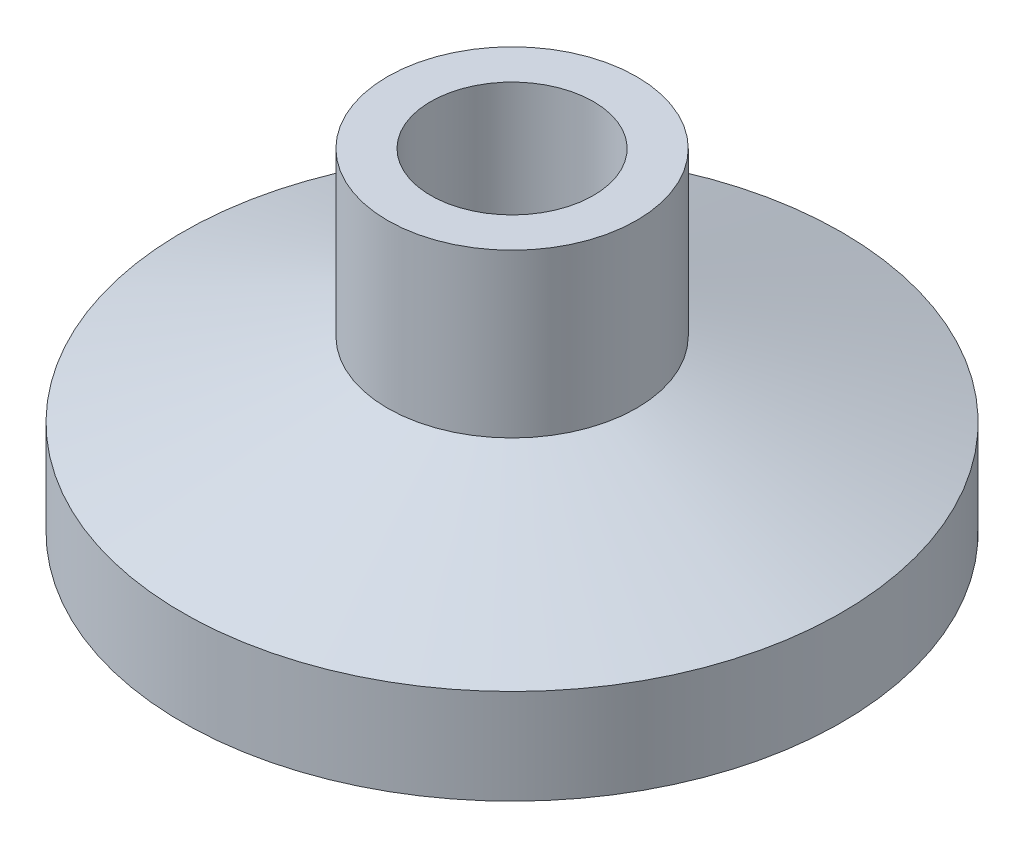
ISO-10303-21;
HEADER;
FILE_DESCRIPTION(('STEP AP214'),'2;1');
FILE_NAME('part.step','',(''),(''),'','','');
FILE_SCHEMA(('AUTOMOTIVE_DESIGN { 1 0 10303 214 1 1 1 1 }'));
ENDSEC;
DATA;
#1=APPLICATION_CONTEXT('core data for automotive mechanical design processes');
#2=APPLICATION_PROTOCOL_DEFINITION('international standard','automotive_design',2000,#1);
#3=PRODUCT_CONTEXT('',#1,'mechanical');
#4=PRODUCT('Part','Part','',(#3));
#5=PRODUCT_RELATED_PRODUCT_CATEGORY('part','',(#4));
#6=PRODUCT_DEFINITION_FORMATION('','',#4);
#7=PRODUCT_DEFINITION_CONTEXT('part definition',#1,'design');
#8=PRODUCT_DEFINITION('design','',#6,#7);
#9=PRODUCT_DEFINITION_SHAPE('','',#8);
#10=(LENGTH_UNIT() NAMED_UNIT(*) SI_UNIT(.MILLI.,.METRE.));
#11=(NAMED_UNIT(*) PLANE_ANGLE_UNIT() SI_UNIT($,.RADIAN.));
#12=(NAMED_UNIT(*) SI_UNIT($,.STERADIAN.) SOLID_ANGLE_UNIT());
#13=UNCERTAINTY_MEASURE_WITH_UNIT(LENGTH_MEASURE(1.E-05),#10,'distance_accuracy_value','');
#14=(GEOMETRIC_REPRESENTATION_CONTEXT(3) GLOBAL_UNCERTAINTY_ASSIGNED_CONTEXT((#13)) GLOBAL_UNIT_ASSIGNED_CONTEXT((#10,
#11,#12)) REPRESENTATION_CONTEXT('',''));
#15=CARTESIAN_POINT('',(0.,0.,0.));
#16=DIRECTION('',(0.,0.,1.));
#17=DIRECTION('',(1.,0.,0.));
#18=AXIS2_PLACEMENT_3D('',#15,#16,#17);
#19=CARTESIAN_POINT('',(0.,0.,0.));
#20=DIRECTION('',(0.,-1.,0.));
#21=DIRECTION('',(0.,0.,-1.));
#22=AXIS2_PLACEMENT_3D('',#19,#20,#21);
#23=CYLINDRICAL_SURFACE('',#22,10.922);
#24=CARTESIAN_POINT('',(0.,1.32079999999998,0.));
#25=DIRECTION('',(0.,-1.,0.));
#26=DIRECTION('',(0.,0.,-1.));
#27=AXIS2_PLACEMENT_3D('',#24,#25,#26);
#28=CIRCLE('',#27,10.922);
#29=CARTESIAN_POINT('',(0.,1.32079999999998,-10.922));
#30=VERTEX_POINT('',#29);
#31=EDGE_CURVE('E12',#30,#30,#28,.T.);
#32=ORIENTED_EDGE('',*,*,#31,.F.);
#33=EDGE_LOOP('',(#32));
#34=FACE_BOUND('',#33,.T.);
#35=CARTESIAN_POINT('',(0.,0.,0.));
#36=DIRECTION('',(0.,-1.,0.));
#37=DIRECTION('',(0.,0.,-1.));
#38=AXIS2_PLACEMENT_3D('',#35,#36,#37);
#39=CIRCLE('',#38,10.922);
#40=CARTESIAN_POINT('',(0.,0.,-10.922));
#41=VERTEX_POINT('',#40);
#42=EDGE_CURVE('E72',#41,#41,#39,.T.);
#43=ORIENTED_EDGE('',*,*,#42,.T.);
#44=EDGE_LOOP('',(#43));
#45=FACE_BOUND('',#44,.T.);
#46=ADVANCED_FACE('F38',(#34,#45),#23,.F.);
#47=CARTESIAN_POINT('',(0.,1.3208,0.));
#48=DIRECTION('',(0.,-1.,0.));
#49=DIRECTION('',(0.,0.,-1.));
#50=AXIS2_PLACEMENT_3D('',#47,#48,#49);
#51=TOROIDAL_SURFACE('',#50,10.1473,0.7747);
#52=CARTESIAN_POINT('',(0.,1.85299891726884,0.));
#53=DIRECTION('',(0.,-1.,0.));
#54=DIRECTION('',(0.,0.,-1.));
#55=AXIS2_PLACEMENT_3D('',#52,#53,#54);
#56=CIRCLE('',#55,9.58433960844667);
#57=CARTESIAN_POINT('',(0.,1.85299891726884,-9.58433960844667));
#58=VERTEX_POINT('',#57);
#59=EDGE_CURVE('E44',#58,#58,#56,.T.);
#60=ORIENTED_EDGE('',*,*,#59,.F.);
#61=EDGE_LOOP('',(#60));
#62=FACE_BOUND('',#61,.T.);
#63=ORIENTED_EDGE('',*,*,#31,.T.);
#64=EDGE_LOOP('',(#63));
#65=FACE_BOUND('',#64,.T.);
#66=ADVANCED_FACE('F121',(#62,#65),#51,.F.);
#67=CARTESIAN_POINT('',(0.,1.85299891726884,0.));
#68=DIRECTION('',(0.,1.,0.));
#69=DIRECTION('',(0.,0.,1.));
#70=AXIS2_PLACEMENT_3D('',#67,#68,#69);
#71=CONICAL_SURFACE('',#70,9.58433960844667,0.794623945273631);
#72=CARTESIAN_POINT('',(0.,0.889000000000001,0.));
#73=DIRECTION('',(0.,-1.,0.));
#74=DIRECTION('',(0.,0.,-1.));
#75=AXIS2_PLACEMENT_3D('',#72,#73,#74);
#76=CIRCLE('',#75,8.60238725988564);
#77=CARTESIAN_POINT('',(0.,0.889000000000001,-8.60238725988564));
#78=VERTEX_POINT('',#77);
#79=EDGE_CURVE('E48',#78,#78,#76,.T.);
#80=ORIENTED_EDGE('',*,*,#79,.F.);
#81=EDGE_LOOP('',(#80));
#82=FACE_BOUND('',#81,.T.);
#83=ORIENTED_EDGE('',*,*,#59,.T.);
#84=EDGE_LOOP('',(#83));
#85=FACE_BOUND('',#84,.T.);
#86=ADVANCED_FACE('F116',(#82,#85),#71,.T.);
#87=CARTESIAN_POINT('',(-8.60238725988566,0.889000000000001,0.));
#88=DIRECTION('',(0.,1.,0.));
#89=DIRECTION('',(0.,0.,1.));
#90=AXIS2_PLACEMENT_3D('',#87,#88,#89);
#91=PLANE('',#90);
#92=CARTESIAN_POINT('',(0.,0.889000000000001,0.));
#93=DIRECTION('',(0.,-1.,0.));
#94=DIRECTION('',(0.,0.,-1.));
#95=AXIS2_PLACEMENT_3D('',#92,#93,#94);
#96=CIRCLE('',#95,3.1115);
#97=CARTESIAN_POINT('',(0.,0.889000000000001,-3.1115));
#98=VERTEX_POINT('',#97);
#99=EDGE_CURVE('E52',#98,#98,#96,.T.);
#100=ORIENTED_EDGE('',*,*,#99,.F.);
#101=EDGE_LOOP('',(#100));
#102=FACE_BOUND('',#101,.T.);
#103=ORIENTED_EDGE('',*,*,#79,.T.);
#104=EDGE_LOOP('',(#103));
#105=FACE_BOUND('',#104,.T.);
#106=ADVANCED_FACE('F110',(#102,#105),#91,.F.);
#107=CARTESIAN_POINT('',(0.,0.,0.));
#108=DIRECTION('',(0.,-1.,0.));
#109=DIRECTION('',(0.,0.,-1.));
#110=AXIS2_PLACEMENT_3D('',#107,#108,#109);
#111=CYLINDRICAL_SURFACE('',#110,3.1115);
#112=CARTESIAN_POINT('',(0.,12.7,0.));
#113=DIRECTION('',(0.,-1.,0.));
#114=DIRECTION('',(0.,0.,-1.));
#115=AXIS2_PLACEMENT_3D('',#112,#113,#114);
#116=CIRCLE('',#115,3.1115);
#117=CARTESIAN_POINT('',(0.,12.7,-3.1115));
#118=VERTEX_POINT('',#117);
#119=EDGE_CURVE('E57',#118,#118,#116,.T.);
#120=ORIENTED_EDGE('',*,*,#119,.F.);
#121=EDGE_LOOP('',(#120));
#122=FACE_BOUND('',#121,.T.);
#123=ORIENTED_EDGE('',*,*,#99,.T.);
#124=EDGE_LOOP('',(#123));
#125=FACE_BOUND('',#124,.T.);
#126=ADVANCED_FACE('F104',(#122,#125),#111,.F.);
#127=CARTESIAN_POINT('',(-3.11149999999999,12.7,0.));
#128=DIRECTION('',(0.,-1.,0.));
#129=DIRECTION('',(0.,0.,-1.));
#130=AXIS2_PLACEMENT_3D('',#127,#128,#129);
#131=PLANE('',#130);
#132=CARTESIAN_POINT('',(0.,12.7,0.));
#133=DIRECTION('',(0.,-1.,0.));
#134=DIRECTION('',(0.,0.,-1.));
#135=AXIS2_PLACEMENT_3D('',#132,#133,#134);
#136=CIRCLE('',#135,4.7625);
#137=CARTESIAN_POINT('',(0.,12.7,-4.7625));
#138=VERTEX_POINT('',#137);
#139=EDGE_CURVE('E60',#138,#138,#136,.T.);
#140=ORIENTED_EDGE('',*,*,#139,.F.);
#141=EDGE_LOOP('',(#140));
#142=FACE_BOUND('',#141,.T.);
#143=ORIENTED_EDGE('',*,*,#119,.T.);
#144=EDGE_LOOP('',(#143));
#145=FACE_BOUND('',#144,.T.);
#146=ADVANCED_FACE('F98',(#142,#145),#131,.F.);
#147=CARTESIAN_POINT('',(0.,0.,0.));
#148=DIRECTION('',(0.,-1.,0.));
#149=DIRECTION('',(0.,0.,-1.));
#150=AXIS2_PLACEMENT_3D('',#147,#148,#149);
#151=CYLINDRICAL_SURFACE('',#150,4.7625);
#152=CARTESIAN_POINT('',(0.,6.48423435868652,0.));
#153=DIRECTION('',(0.,-1.,0.));
#154=DIRECTION('',(0.,0.,-1.));
#155=AXIS2_PLACEMENT_3D('',#152,#153,#154);
#156=CIRCLE('',#155,4.7625);
#157=CARTESIAN_POINT('',(0.,6.48423435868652,-4.7625));
#158=VERTEX_POINT('',#157);
#159=EDGE_CURVE('E63',#158,#158,#156,.T.);
#160=ORIENTED_EDGE('',*,*,#159,.F.);
#161=EDGE_LOOP('',(#160));
#162=FACE_BOUND('',#161,.T.);
#163=ORIENTED_EDGE('',*,*,#139,.T.);
#164=EDGE_LOOP('',(#163));
#165=FACE_BOUND('',#164,.T.);
#166=ADVANCED_FACE('F92',(#162,#165),#151,.T.);
#167=CARTESIAN_POINT('',(0.,6.48423435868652,0.));
#168=DIRECTION('',(0.,-1.,0.));
#169=DIRECTION('',(0.,0.,-1.));
#170=AXIS2_PLACEMENT_3D('',#167,#168,#169);
#171=CONICAL_SURFACE('',#170,4.7625,1.22173047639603);
#172=CARTESIAN_POINT('',(0.,3.6322,0.));
#173=DIRECTION('',(0.,-1.,0.));
#174=DIRECTION('',(0.,0.,-1.));
#175=AXIS2_PLACEMENT_3D('',#172,#173,#174);
#176=CIRCLE('',#175,12.5984);
#177=CARTESIAN_POINT('',(0.,3.6322,-12.5984));
#178=VERTEX_POINT('',#177);
#179=EDGE_CURVE('E66',#178,#178,#176,.T.);
#180=ORIENTED_EDGE('',*,*,#179,.F.);
#181=EDGE_LOOP('',(#180));
#182=FACE_BOUND('',#181,.T.);
#183=ORIENTED_EDGE('',*,*,#159,.T.);
#184=EDGE_LOOP('',(#183));
#185=FACE_BOUND('',#184,.T.);
#186=ADVANCED_FACE('F86',(#182,#185),#171,.T.);
#187=CARTESIAN_POINT('',(0.,0.,0.));
#188=DIRECTION('',(0.,-1.,0.));
#189=DIRECTION('',(0.,0.,-1.));
#190=AXIS2_PLACEMENT_3D('',#187,#188,#189);
#191=CYLINDRICAL_SURFACE('',#190,12.5984);
#192=CARTESIAN_POINT('',(0.,0.,0.));
#193=DIRECTION('',(0.,-1.,0.));
#194=DIRECTION('',(0.,0.,-1.));
#195=AXIS2_PLACEMENT_3D('',#192,#193,#194);
#196=CIRCLE('',#195,12.5984);
#197=CARTESIAN_POINT('',(0.,0.,-12.5984));
#198=VERTEX_POINT('',#197);
#199=EDGE_CURVE('E69',#198,#198,#196,.T.);
#200=ORIENTED_EDGE('',*,*,#199,.F.);
#201=EDGE_LOOP('',(#200));
#202=FACE_BOUND('',#201,.T.);
#203=ORIENTED_EDGE('',*,*,#179,.T.);
#204=EDGE_LOOP('',(#203));
#205=FACE_BOUND('',#204,.T.);
#206=ADVANCED_FACE('F80',(#202,#205),#191,.T.);
#207=CARTESIAN_POINT('',(-12.5984,0.,0.));
#208=DIRECTION('',(0.,1.,0.));
#209=DIRECTION('',(0.,0.,1.));
#210=AXIS2_PLACEMENT_3D('',#207,#208,#209);
#211=PLANE('',#210);
#212=ORIENTED_EDGE('',*,*,#42,.F.);
#213=EDGE_LOOP('',(#212));
#214=FACE_BOUND('',#213,.T.);
#215=ORIENTED_EDGE('',*,*,#199,.T.);
#216=EDGE_LOOP('',(#215));
#217=FACE_BOUND('',#216,.T.);
#218=ADVANCED_FACE('F77',(#214,#217),#211,.F.);
#219=CLOSED_SHELL('',(#46,#66,#86,#106,#126,#146,#166,#186,#206,#218));
#220=MANIFOLD_SOLID_BREP('B2',#219);
#221=ADVANCED_BREP_SHAPE_REPRESENTATION('',(#18,#220),#14);
#222=SHAPE_DEFINITION_REPRESENTATION(#9,#221);
ENDSEC;
END-ISO-10303-21;
